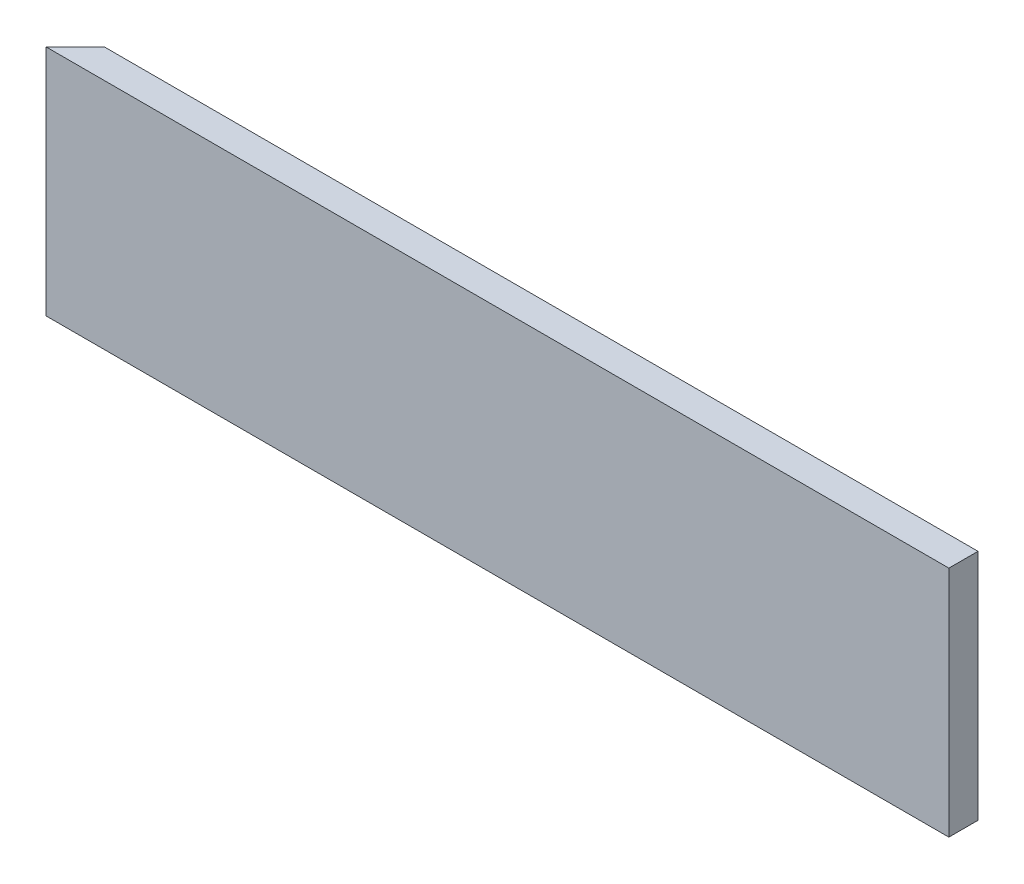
ISO-10303-21;
HEADER;
FILE_DESCRIPTION(('STEP AP214'),'2;1');
FILE_NAME('part.step','',(''),(''),'','','');
FILE_SCHEMA(('AUTOMOTIVE_DESIGN { 1 0 10303 214 1 1 1 1 }'));
ENDSEC;
DATA;
#1=APPLICATION_CONTEXT('core data for automotive mechanical design processes');
#2=APPLICATION_PROTOCOL_DEFINITION('international standard','automotive_design',2000,#1);
#3=PRODUCT_CONTEXT('',#1,'mechanical');
#4=PRODUCT('Part','Part','',(#3));
#5=PRODUCT_RELATED_PRODUCT_CATEGORY('part','',(#4));
#6=PRODUCT_DEFINITION_FORMATION('','',#4);
#7=PRODUCT_DEFINITION_CONTEXT('part definition',#1,'design');
#8=PRODUCT_DEFINITION('design','',#6,#7);
#9=PRODUCT_DEFINITION_SHAPE('','',#8);
#10=(LENGTH_UNIT() NAMED_UNIT(*) SI_UNIT(.MILLI.,.METRE.));
#11=(NAMED_UNIT(*) PLANE_ANGLE_UNIT() SI_UNIT($,.RADIAN.));
#12=(NAMED_UNIT(*) SI_UNIT($,.STERADIAN.) SOLID_ANGLE_UNIT());
#13=UNCERTAINTY_MEASURE_WITH_UNIT(LENGTH_MEASURE(1.E-05),#10,'distance_accuracy_value','');
#14=(GEOMETRIC_REPRESENTATION_CONTEXT(3) GLOBAL_UNCERTAINTY_ASSIGNED_CONTEXT((#13)) GLOBAL_UNIT_ASSIGNED_CONTEXT((#10,
#11,#12)) REPRESENTATION_CONTEXT('',''));
#15=CARTESIAN_POINT('',(0.,0.,0.));
#16=DIRECTION('',(0.,0.,1.));
#17=DIRECTION('',(1.,0.,0.));
#18=AXIS2_PLACEMENT_3D('',#15,#16,#17);
#19=CARTESIAN_POINT('',(-762.,203.2,0.));
#20=DIRECTION('',(0.,0.,1.));
#21=DIRECTION('',(1.,0.,0.));
#22=AXIS2_PLACEMENT_3D('',#19,#20,#21);
#23=PLANE('',#22);
#24=DIRECTION('',(-1.,0.,0.));
#25=VECTOR('',#24,1.);
#26=CARTESIAN_POINT('',(-762.,0.,0.));
#27=LINE('',#26,#25);
#28=CARTESIAN_POINT('',(0.,0.,0.));
#29=VERTEX_POINT('',#28);
#30=CARTESIAN_POINT('',(-762.,0.,0.));
#31=VERTEX_POINT('',#30);
#32=EDGE_CURVE('E102',#29,#31,#27,.T.);
#33=ORIENTED_EDGE('',*,*,#32,.T.);
#34=DIRECTION('',(0.,-1.,0.));
#35=VECTOR('',#34,1.);
#36=CARTESIAN_POINT('',(-762.,203.2,0.));
#37=LINE('',#36,#35);
#38=CARTESIAN_POINT('',(-762.,203.2,0.));
#39=VERTEX_POINT('',#38);
#40=EDGE_CURVE('E11',#39,#31,#37,.T.);
#41=ORIENTED_EDGE('',*,*,#40,.F.);
#42=DIRECTION('',(-1.,0.,0.));
#43=VECTOR('',#42,1.);
#44=CARTESIAN_POINT('',(-762.,203.2,0.));
#45=LINE('',#44,#43);
#46=CARTESIAN_POINT('',(0.,203.2,0.));
#47=VERTEX_POINT('',#46);
#48=EDGE_CURVE('E90',#47,#39,#45,.T.);
#49=ORIENTED_EDGE('',*,*,#48,.F.);
#50=DIRECTION('',(0.,-1.,0.));
#51=VECTOR('',#50,1.);
#52=CARTESIAN_POINT('',(0.,203.2,0.));
#53=LINE('',#52,#51);
#54=EDGE_CURVE('E98',#47,#29,#53,.T.);
#55=ORIENTED_EDGE('',*,*,#54,.T.);
#56=EDGE_LOOP('',(#33,#41,#49,#55));
#57=FACE_BOUND('',#56,.T.);
#58=ADVANCED_FACE('F39',(#57),#23,.F.);
#59=CARTESIAN_POINT('',(-787.4,203.2,25.4000000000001));
#60=DIRECTION('',(0.707106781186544,0.,0.70710678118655));
#61=DIRECTION('',(0.707106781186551,0.,-0.707106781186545));
#62=AXIS2_PLACEMENT_3D('',#59,#60,#61);
#63=PLANE('',#62);
#64=DIRECTION('',(-0.707106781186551,0.,0.707106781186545));
#65=VECTOR('',#64,1.);
#66=CARTESIAN_POINT('',(-787.4,0.,25.4000000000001));
#67=LINE('',#66,#65);
#68=CARTESIAN_POINT('',(-787.4,0.,25.4000000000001));
#69=VERTEX_POINT('',#68);
#70=EDGE_CURVE('E94',#31,#69,#67,.T.);
#71=ORIENTED_EDGE('',*,*,#70,.T.);
#72=DIRECTION('',(0.,-1.,0.));
#73=VECTOR('',#72,1.);
#74=CARTESIAN_POINT('',(-787.4,203.2,25.4000000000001));
#75=LINE('',#74,#73);
#76=CARTESIAN_POINT('',(-787.4,203.2,25.4000000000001));
#77=VERTEX_POINT('',#76);
#78=EDGE_CURVE('E47',#77,#69,#75,.T.);
#79=ORIENTED_EDGE('',*,*,#78,.F.);
#80=DIRECTION('',(-0.707106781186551,0.,0.707106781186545));
#81=VECTOR('',#80,1.);
#82=CARTESIAN_POINT('',(-787.4,203.2,25.4000000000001));
#83=LINE('',#82,#81);
#84=EDGE_CURVE('E85',#39,#77,#83,.T.);
#85=ORIENTED_EDGE('',*,*,#84,.F.);
#86=ORIENTED_EDGE('',*,*,#40,.T.);
#87=EDGE_LOOP('',(#71,#79,#85,#86));
#88=FACE_BOUND('',#87,.T.);
#89=ADVANCED_FACE('F93',(#88),#63,.F.);
#90=CARTESIAN_POINT('',(0.,203.2,25.4));
#91=DIRECTION('',(0.,0.,-1.));
#92=DIRECTION('',(-1.,0.,0.));
#93=AXIS2_PLACEMENT_3D('',#90,#91,#92);
#94=PLANE('',#93);
#95=DIRECTION('',(1.,0.,0.));
#96=VECTOR('',#95,1.);
#97=CARTESIAN_POINT('',(0.,0.,25.4));
#98=LINE('',#97,#96);
#99=CARTESIAN_POINT('',(0.,0.,25.4));
#100=VERTEX_POINT('',#99);
#101=EDGE_CURVE('E72',#69,#100,#98,.T.);
#102=ORIENTED_EDGE('',*,*,#101,.T.);
#103=DIRECTION('',(0.,-1.,0.));
#104=VECTOR('',#103,1.);
#105=CARTESIAN_POINT('',(0.,203.2,25.4));
#106=LINE('',#105,#104);
#107=CARTESIAN_POINT('',(0.,203.2,25.4));
#108=VERTEX_POINT('',#107);
#109=EDGE_CURVE('E95',#108,#100,#106,.T.);
#110=ORIENTED_EDGE('',*,*,#109,.F.);
#111=DIRECTION('',(1.,0.,0.));
#112=VECTOR('',#111,1.);
#113=CARTESIAN_POINT('',(0.,203.2,25.4));
#114=LINE('',#113,#112);
#115=EDGE_CURVE('E88',#77,#108,#114,.T.);
#116=ORIENTED_EDGE('',*,*,#115,.F.);
#117=ORIENTED_EDGE('',*,*,#78,.T.);
#118=EDGE_LOOP('',(#102,#110,#116,#117));
#119=FACE_BOUND('',#118,.T.);
#120=ADVANCED_FACE('F96',(#119),#94,.F.);
#121=CARTESIAN_POINT('',(0.,203.2,0.));
#122=DIRECTION('',(-1.,0.,0.));
#123=DIRECTION('',(0.,0.,1.));
#124=AXIS2_PLACEMENT_3D('',#121,#122,#123);
#125=PLANE('',#124);
#126=DIRECTION('',(0.,0.,-1.));
#127=VECTOR('',#126,1.);
#128=CARTESIAN_POINT('',(0.,0.,0.));
#129=LINE('',#128,#127);
#130=EDGE_CURVE('E78',#100,#29,#129,.T.);
#131=ORIENTED_EDGE('',*,*,#130,.T.);
#132=ORIENTED_EDGE('',*,*,#54,.F.);
#133=DIRECTION('',(0.,0.,-1.));
#134=VECTOR('',#133,1.);
#135=CARTESIAN_POINT('',(0.,203.2,0.));
#136=LINE('',#135,#134);
#137=EDGE_CURVE('E55',#108,#47,#136,.T.);
#138=ORIENTED_EDGE('',*,*,#137,.F.);
#139=ORIENTED_EDGE('',*,*,#109,.T.);
#140=EDGE_LOOP('',(#131,#132,#138,#139));
#141=FACE_BOUND('',#140,.T.);
#142=ADVANCED_FACE('F109',(#141),#125,.F.);
#143=CARTESIAN_POINT('',(0.,203.2,0.));
#144=DIRECTION('',(0.,-1.,0.));
#145=DIRECTION('',(0.,0.,-1.));
#146=AXIS2_PLACEMENT_3D('',#143,#144,#145);
#147=PLANE('',#146);
#148=ORIENTED_EDGE('',*,*,#48,.T.);
#149=ORIENTED_EDGE('',*,*,#84,.T.);
#150=ORIENTED_EDGE('',*,*,#115,.T.);
#151=ORIENTED_EDGE('',*,*,#137,.T.);
#152=EDGE_LOOP('',(#148,#149,#150,#151));
#153=FACE_BOUND('',#152,.T.);
#154=ADVANCED_FACE('F86',(#153),#147,.F.);
#155=CARTESIAN_POINT('',(0.,0.,0.));
#156=DIRECTION('',(0.,-1.,0.));
#157=DIRECTION('',(0.,0.,-1.));
#158=AXIS2_PLACEMENT_3D('',#155,#156,#157);
#159=PLANE('',#158);
#160=ORIENTED_EDGE('',*,*,#32,.F.);
#161=ORIENTED_EDGE('',*,*,#130,.F.);
#162=ORIENTED_EDGE('',*,*,#101,.F.);
#163=ORIENTED_EDGE('',*,*,#70,.F.);
#164=EDGE_LOOP('',(#160,#161,#162,#163));
#165=FACE_BOUND('',#164,.T.);
#166=ADVANCED_FACE('F112',(#165),#159,.T.);
#167=CLOSED_SHELL('',(#58,#89,#120,#142,#154,#166));
#168=MANIFOLD_SOLID_BREP('B2',#167);
#169=ADVANCED_BREP_SHAPE_REPRESENTATION('',(#18,#168),#14);
#170=SHAPE_DEFINITION_REPRESENTATION(#9,#169);
ENDSEC;
END-ISO-10303-21;
